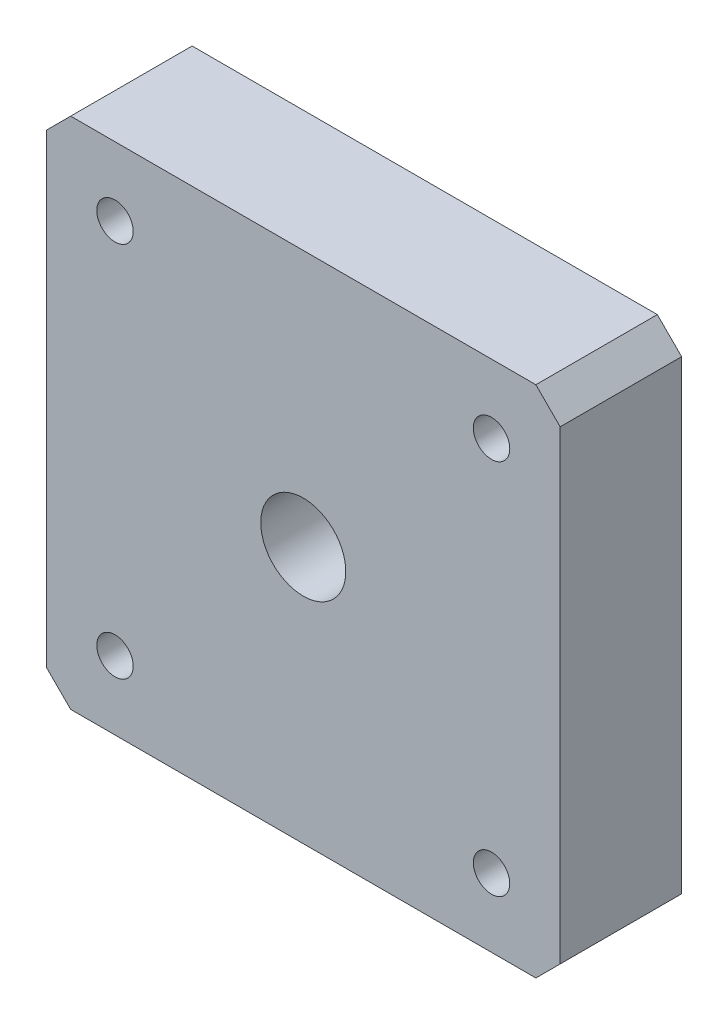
ISO-10303-21;
HEADER;
FILE_DESCRIPTION(('STEP AP214'),'2;1');
FILE_NAME('part.step','',(''),(''),'','','');
FILE_SCHEMA(('AUTOMOTIVE_DESIGN { 1 0 10303 214 1 1 1 1 }'));
ENDSEC;
DATA;
#1=APPLICATION_CONTEXT('core data for automotive mechanical design processes');
#2=APPLICATION_PROTOCOL_DEFINITION('international standard','automotive_design',2000,#1);
#3=PRODUCT_CONTEXT('',#1,'mechanical');
#4=PRODUCT('Part','Part','',(#3));
#5=PRODUCT_RELATED_PRODUCT_CATEGORY('part','',(#4));
#6=PRODUCT_DEFINITION_FORMATION('','',#4);
#7=PRODUCT_DEFINITION_CONTEXT('part definition',#1,'design');
#8=PRODUCT_DEFINITION('design','',#6,#7);
#9=PRODUCT_DEFINITION_SHAPE('','',#8);
#10=(LENGTH_UNIT() NAMED_UNIT(*) SI_UNIT(.MILLI.,.METRE.));
#11=(NAMED_UNIT(*) PLANE_ANGLE_UNIT() SI_UNIT($,.RADIAN.));
#12=(NAMED_UNIT(*) SI_UNIT($,.STERADIAN.) SOLID_ANGLE_UNIT());
#13=UNCERTAINTY_MEASURE_WITH_UNIT(LENGTH_MEASURE(1.E-05),#10,'distance_accuracy_value','');
#14=(GEOMETRIC_REPRESENTATION_CONTEXT(3) GLOBAL_UNCERTAINTY_ASSIGNED_CONTEXT((#13)) GLOBAL_UNIT_ASSIGNED_CONTEXT((#10,
#11,#12)) REPRESENTATION_CONTEXT('',''));
#15=CARTESIAN_POINT('',(0.,0.,0.));
#16=DIRECTION('',(0.,0.,1.));
#17=DIRECTION('',(1.,0.,0.));
#18=AXIS2_PLACEMENT_3D('',#15,#16,#17);
#19=CARTESIAN_POINT('',(-21.15,-19.15,10.));
#20=DIRECTION('',(1.,0.,0.));
#21=DIRECTION('',(0.,0.,-1.));
#22=AXIS2_PLACEMENT_3D('',#19,#20,#21);
#23=PLANE('',#22);
#24=DIRECTION('',(0.,-1.,0.));
#25=VECTOR('',#24,1.);
#26=CARTESIAN_POINT('',(-21.15,-19.15,0.));
#27=LINE('',#26,#25);
#28=CARTESIAN_POINT('',(-21.15,19.15,0.));
#29=VERTEX_POINT('',#28);
#30=CARTESIAN_POINT('',(-21.15,-19.15,0.));
#31=VERTEX_POINT('',#30);
#32=EDGE_CURVE('E129',#29,#31,#27,.T.);
#33=ORIENTED_EDGE('',*,*,#32,.T.);
#34=DIRECTION('',(0.,0.,-1.));
#35=VECTOR('',#34,1.);
#36=CARTESIAN_POINT('',(-21.15,-19.15,10.));
#37=LINE('',#36,#35);
#38=CARTESIAN_POINT('',(-21.15,-19.15,10.));
#39=VERTEX_POINT('',#38);
#40=EDGE_CURVE('E11',#39,#31,#37,.T.);
#41=ORIENTED_EDGE('',*,*,#40,.F.);
#42=DIRECTION('',(0.,-1.,0.));
#43=VECTOR('',#42,1.);
#44=CARTESIAN_POINT('',(-21.15,-19.15,10.));
#45=LINE('',#44,#43);
#46=CARTESIAN_POINT('',(-21.15,19.15,10.));
#47=VERTEX_POINT('',#46);
#48=EDGE_CURVE('E144',#47,#39,#45,.T.);
#49=ORIENTED_EDGE('',*,*,#48,.F.);
#50=DIRECTION('',(0.,0.,-1.));
#51=VECTOR('',#50,1.);
#52=CARTESIAN_POINT('',(-21.15,19.15,10.));
#53=LINE('',#52,#51);
#54=EDGE_CURVE('E125',#47,#29,#53,.T.);
#55=ORIENTED_EDGE('',*,*,#54,.T.);
#56=EDGE_LOOP('',(#33,#41,#49,#55));
#57=FACE_BOUND('',#56,.T.);
#58=ADVANCED_FACE('F33',(#57),#23,.F.);
#59=CARTESIAN_POINT('',(-21.15,-19.15,10.));
#60=DIRECTION('',(0.707106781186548,0.707106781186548,0.));
#61=DIRECTION('',(-0.707106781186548,0.707106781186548,0.));
#62=AXIS2_PLACEMENT_3D('',#59,#60,#61);
#63=PLANE('',#62);
#64=DIRECTION('',(0.707106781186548,-0.707106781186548,0.));
#65=VECTOR('',#64,1.);
#66=CARTESIAN_POINT('',(-21.15,-19.15,0.));
#67=LINE('',#66,#65);
#68=CARTESIAN_POINT('',(-19.15,-21.15,0.));
#69=VERTEX_POINT('',#68);
#70=EDGE_CURVE('E132',#31,#69,#67,.T.);
#71=ORIENTED_EDGE('',*,*,#70,.T.);
#72=DIRECTION('',(0.,0.,-1.));
#73=VECTOR('',#72,1.);
#74=CARTESIAN_POINT('',(-19.15,-21.15,10.));
#75=LINE('',#74,#73);
#76=CARTESIAN_POINT('',(-19.15,-21.15,10.));
#77=VERTEX_POINT('',#76);
#78=EDGE_CURVE('E41',#77,#69,#75,.T.);
#79=ORIENTED_EDGE('',*,*,#78,.F.);
#80=DIRECTION('',(0.707106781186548,-0.707106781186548,0.));
#81=VECTOR('',#80,1.);
#82=CARTESIAN_POINT('',(-21.15,-19.15,10.));
#83=LINE('',#82,#81);
#84=EDGE_CURVE('E92',#39,#77,#83,.T.);
#85=ORIENTED_EDGE('',*,*,#84,.F.);
#86=ORIENTED_EDGE('',*,*,#40,.T.);
#87=EDGE_LOOP('',(#71,#79,#85,#86));
#88=FACE_BOUND('',#87,.T.);
#89=ADVANCED_FACE('F246',(#88),#63,.F.);
#90=CARTESIAN_POINT('',(19.15,-21.15,10.));
#91=DIRECTION('',(0.,1.,0.));
#92=DIRECTION('',(-1.,0.,0.));
#93=AXIS2_PLACEMENT_3D('',#90,#91,#92);
#94=PLANE('',#93);
#95=DIRECTION('',(1.,0.,0.));
#96=VECTOR('',#95,1.);
#97=CARTESIAN_POINT('',(19.15,-21.15,0.));
#98=LINE('',#97,#96);
#99=CARTESIAN_POINT('',(19.15,-21.15,0.));
#100=VERTEX_POINT('',#99);
#101=EDGE_CURVE('E135',#69,#100,#98,.T.);
#102=ORIENTED_EDGE('',*,*,#101,.T.);
#103=DIRECTION('',(0.,0.,-1.));
#104=VECTOR('',#103,1.);
#105=CARTESIAN_POINT('',(19.15,-21.15,10.));
#106=LINE('',#105,#104);
#107=CARTESIAN_POINT('',(19.15,-21.15,10.));
#108=VERTEX_POINT('',#107);
#109=EDGE_CURVE('E151',#108,#100,#106,.T.);
#110=ORIENTED_EDGE('',*,*,#109,.F.);
#111=DIRECTION('',(1.,0.,0.));
#112=VECTOR('',#111,1.);
#113=CARTESIAN_POINT('',(19.15,-21.15,10.));
#114=LINE('',#113,#112);
#115=EDGE_CURVE('E159',#77,#108,#114,.T.);
#116=ORIENTED_EDGE('',*,*,#115,.F.);
#117=ORIENTED_EDGE('',*,*,#78,.T.);
#118=EDGE_LOOP('',(#102,#110,#116,#117));
#119=FACE_BOUND('',#118,.T.);
#120=ADVANCED_FACE('F157',(#119),#94,.F.);
#121=CARTESIAN_POINT('',(21.15,-19.15,10.));
#122=DIRECTION('',(-0.707106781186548,0.707106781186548,0.));
#123=DIRECTION('',(-0.707106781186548,-0.707106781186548,0.));
#124=AXIS2_PLACEMENT_3D('',#121,#122,#123);
#125=PLANE('',#124);
#126=DIRECTION('',(0.707106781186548,0.707106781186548,0.));
#127=VECTOR('',#126,1.);
#128=CARTESIAN_POINT('',(21.15,-19.15,0.));
#129=LINE('',#128,#127);
#130=CARTESIAN_POINT('',(21.15,-19.15,0.));
#131=VERTEX_POINT('',#130);
#132=EDGE_CURVE('E137',#100,#131,#129,.T.);
#133=ORIENTED_EDGE('',*,*,#132,.T.);
#134=DIRECTION('',(0.,0.,-1.));
#135=VECTOR('',#134,1.);
#136=CARTESIAN_POINT('',(21.15,-19.15,10.));
#137=LINE('',#136,#135);
#138=CARTESIAN_POINT('',(21.15,-19.15,10.));
#139=VERTEX_POINT('',#138);
#140=EDGE_CURVE('E148',#139,#131,#137,.T.);
#141=ORIENTED_EDGE('',*,*,#140,.F.);
#142=DIRECTION('',(0.707106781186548,0.707106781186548,0.));
#143=VECTOR('',#142,1.);
#144=CARTESIAN_POINT('',(21.15,-19.15,10.));
#145=LINE('',#144,#143);
#146=EDGE_CURVE('E171',#108,#139,#145,.T.);
#147=ORIENTED_EDGE('',*,*,#146,.F.);
#148=ORIENTED_EDGE('',*,*,#109,.T.);
#149=EDGE_LOOP('',(#133,#141,#147,#148));
#150=FACE_BOUND('',#149,.T.);
#151=ADVANCED_FACE('F167',(#150),#125,.F.);
#152=CARTESIAN_POINT('',(21.15,-19.15,10.));
#153=DIRECTION('',(-1.,0.,0.));
#154=DIRECTION('',(0.,0.,1.));
#155=AXIS2_PLACEMENT_3D('',#152,#153,#154);
#156=PLANE('',#155);
#157=DIRECTION('',(0.,1.,0.));
#158=VECTOR('',#157,1.);
#159=CARTESIAN_POINT('',(21.15,-19.15,0.));
#160=LINE('',#159,#158);
#161=CARTESIAN_POINT('',(21.15,19.15,0.));
#162=VERTEX_POINT('',#161);
#163=EDGE_CURVE('E139',#131,#162,#160,.T.);
#164=ORIENTED_EDGE('',*,*,#163,.T.);
#165=DIRECTION('',(0.,0.,-1.));
#166=VECTOR('',#165,1.);
#167=CARTESIAN_POINT('',(21.15,19.15,10.));
#168=LINE('',#167,#166);
#169=CARTESIAN_POINT('',(21.15,19.15,10.));
#170=VERTEX_POINT('',#169);
#171=EDGE_CURVE('E120',#170,#162,#168,.T.);
#172=ORIENTED_EDGE('',*,*,#171,.F.);
#173=DIRECTION('',(0.,1.,0.));
#174=VECTOR('',#173,1.);
#175=CARTESIAN_POINT('',(21.15,-19.15,10.));
#176=LINE('',#175,#174);
#177=EDGE_CURVE('E111',#139,#170,#176,.T.);
#178=ORIENTED_EDGE('',*,*,#177,.F.);
#179=ORIENTED_EDGE('',*,*,#140,.T.);
#180=EDGE_LOOP('',(#164,#172,#178,#179));
#181=FACE_BOUND('',#180,.T.);
#182=ADVANCED_FACE('F170',(#181),#156,.F.);
#183=CARTESIAN_POINT('',(19.15,21.15,10.));
#184=DIRECTION('',(-0.707106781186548,-0.707106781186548,0.));
#185=DIRECTION('',(0.707106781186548,-0.707106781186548,0.));
#186=AXIS2_PLACEMENT_3D('',#183,#184,#185);
#187=PLANE('',#186);
#188=DIRECTION('',(-0.707106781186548,0.707106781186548,0.));
#189=VECTOR('',#188,1.);
#190=CARTESIAN_POINT('',(19.15,21.15,0.));
#191=LINE('',#190,#189);
#192=CARTESIAN_POINT('',(19.15,21.15,0.));
#193=VERTEX_POINT('',#192);
#194=EDGE_CURVE('E119',#162,#193,#191,.T.);
#195=ORIENTED_EDGE('',*,*,#194,.T.);
#196=DIRECTION('',(0.,0.,-1.));
#197=VECTOR('',#196,1.);
#198=CARTESIAN_POINT('',(19.15,21.15,10.));
#199=LINE('',#198,#197);
#200=CARTESIAN_POINT('',(19.15,21.15,10.));
#201=VERTEX_POINT('',#200);
#202=EDGE_CURVE('E116',#201,#193,#199,.T.);
#203=ORIENTED_EDGE('',*,*,#202,.F.);
#204=DIRECTION('',(-0.707106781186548,0.707106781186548,0.));
#205=VECTOR('',#204,1.);
#206=CARTESIAN_POINT('',(19.15,21.15,10.));
#207=LINE('',#206,#205);
#208=EDGE_CURVE('E105',#170,#201,#207,.T.);
#209=ORIENTED_EDGE('',*,*,#208,.F.);
#210=ORIENTED_EDGE('',*,*,#171,.T.);
#211=EDGE_LOOP('',(#195,#203,#209,#210));
#212=FACE_BOUND('',#211,.T.);
#213=ADVANCED_FACE('F117',(#212),#187,.F.);
#214=CARTESIAN_POINT('',(19.15,21.15,10.));
#215=DIRECTION('',(0.,-1.,0.));
#216=DIRECTION('',(1.,0.,0.));
#217=AXIS2_PLACEMENT_3D('',#214,#215,#216);
#218=PLANE('',#217);
#219=DIRECTION('',(-1.,0.,0.));
#220=VECTOR('',#219,1.);
#221=CARTESIAN_POINT('',(19.15,21.15,0.));
#222=LINE('',#221,#220);
#223=CARTESIAN_POINT('',(-19.15,21.15,0.));
#224=VERTEX_POINT('',#223);
#225=EDGE_CURVE('E78',#193,#224,#222,.T.);
#226=ORIENTED_EDGE('',*,*,#225,.T.);
#227=DIRECTION('',(0.,0.,-1.));
#228=VECTOR('',#227,1.);
#229=CARTESIAN_POINT('',(-19.15,21.15,10.));
#230=LINE('',#229,#228);
#231=CARTESIAN_POINT('',(-19.15,21.15,10.));
#232=VERTEX_POINT('',#231);
#233=EDGE_CURVE('E121',#232,#224,#230,.T.);
#234=ORIENTED_EDGE('',*,*,#233,.F.);
#235=DIRECTION('',(-1.,0.,0.));
#236=VECTOR('',#235,1.);
#237=CARTESIAN_POINT('',(19.15,21.15,10.));
#238=LINE('',#237,#236);
#239=EDGE_CURVE('E109',#201,#232,#238,.T.);
#240=ORIENTED_EDGE('',*,*,#239,.F.);
#241=ORIENTED_EDGE('',*,*,#202,.T.);
#242=EDGE_LOOP('',(#226,#234,#240,#241));
#243=FACE_BOUND('',#242,.T.);
#244=ADVANCED_FACE('F123',(#243),#218,.F.);
#245=CARTESIAN_POINT('',(-19.15,21.15,10.));
#246=DIRECTION('',(0.707106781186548,-0.707106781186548,0.));
#247=DIRECTION('',(0.707106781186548,0.707106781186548,0.));
#248=AXIS2_PLACEMENT_3D('',#245,#246,#247);
#249=PLANE('',#248);
#250=DIRECTION('',(-0.707106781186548,-0.707106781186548,0.));
#251=VECTOR('',#250,1.);
#252=CARTESIAN_POINT('',(-19.15,21.15,0.));
#253=LINE('',#252,#251);
#254=EDGE_CURVE('E84',#224,#29,#253,.T.);
#255=ORIENTED_EDGE('',*,*,#254,.T.);
#256=ORIENTED_EDGE('',*,*,#54,.F.);
#257=DIRECTION('',(-0.707106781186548,-0.707106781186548,0.));
#258=VECTOR('',#257,1.);
#259=CARTESIAN_POINT('',(-19.15,21.15,10.));
#260=LINE('',#259,#258);
#261=EDGE_CURVE('E49',#232,#47,#260,.T.);
#262=ORIENTED_EDGE('',*,*,#261,.F.);
#263=ORIENTED_EDGE('',*,*,#233,.T.);
#264=EDGE_LOOP('',(#255,#256,#262,#263));
#265=FACE_BOUND('',#264,.T.);
#266=ADVANCED_FACE('F253',(#265),#249,.F.);
#267=CARTESIAN_POINT('',(0.,0.,10.));
#268=DIRECTION('',(0.,0.,1.));
#269=DIRECTION('',(1.,0.,0.));
#270=AXIS2_PLACEMENT_3D('',#267,#268,#269);
#271=PLANE('',#270);
#272=CARTESIAN_POINT('',(-15.4999999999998,15.5000000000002,10.));
#273=DIRECTION('',(0.,0.,1.));
#274=DIRECTION('',(1.,0.,0.));
#275=AXIS2_PLACEMENT_3D('',#272,#273,#274);
#276=CIRCLE('',#275,1.5);
#277=CARTESIAN_POINT('',(-13.9999999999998,15.5000000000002,10.));
#278=VERTEX_POINT('',#277);
#279=EDGE_CURVE('E212',#278,#278,#276,.T.);
#280=ORIENTED_EDGE('',*,*,#279,.F.);
#281=EDGE_LOOP('',(#280));
#282=FACE_BOUND('',#281,.T.);
#283=CARTESIAN_POINT('',(-15.5,-15.5,10.));
#284=DIRECTION('',(0.,0.,1.));
#285=DIRECTION('',(1.,0.,0.));
#286=AXIS2_PLACEMENT_3D('',#283,#284,#285);
#287=CIRCLE('',#286,1.5);
#288=CARTESIAN_POINT('',(-14.,-15.5,10.));
#289=VERTEX_POINT('',#288);
#290=EDGE_CURVE('E206',#289,#289,#287,.T.);
#291=ORIENTED_EDGE('',*,*,#290,.F.);
#292=EDGE_LOOP('',(#291));
#293=FACE_BOUND('',#292,.T.);
#294=CARTESIAN_POINT('',(15.4999999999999,-15.5000000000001,10.));
#295=DIRECTION('',(0.,0.,1.));
#296=DIRECTION('',(1.,0.,0.));
#297=AXIS2_PLACEMENT_3D('',#294,#295,#296);
#298=CIRCLE('',#297,1.5);
#299=CARTESIAN_POINT('',(16.9999999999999,-15.5000000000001,10.));
#300=VERTEX_POINT('',#299);
#301=EDGE_CURVE('E200',#300,#300,#298,.T.);
#302=ORIENTED_EDGE('',*,*,#301,.F.);
#303=EDGE_LOOP('',(#302));
#304=FACE_BOUND('',#303,.T.);
#305=CARTESIAN_POINT('',(15.5,15.5,10.));
#306=DIRECTION('',(0.,0.,1.));
#307=DIRECTION('',(1.,0.,0.));
#308=AXIS2_PLACEMENT_3D('',#305,#306,#307);
#309=CIRCLE('',#308,1.5);
#310=CARTESIAN_POINT('',(17.,15.5,10.));
#311=VERTEX_POINT('',#310);
#312=EDGE_CURVE('E192',#311,#311,#309,.T.);
#313=ORIENTED_EDGE('',*,*,#312,.F.);
#314=EDGE_LOOP('',(#313));
#315=FACE_BOUND('',#314,.T.);
#316=CARTESIAN_POINT('',(0.,0.,10.));
#317=DIRECTION('',(0.,0.,-1.));
#318=DIRECTION('',(-1.,0.,0.));
#319=AXIS2_PLACEMENT_3D('',#316,#317,#318);
#320=CIRCLE('',#319,3.5);
#321=CARTESIAN_POINT('',(-3.5,0.,10.));
#322=VERTEX_POINT('',#321);
#323=EDGE_CURVE('E188',#322,#322,#320,.T.);
#324=ORIENTED_EDGE('',*,*,#323,.T.);
#325=EDGE_LOOP('',(#324));
#326=FACE_BOUND('',#325,.T.);
#327=ORIENTED_EDGE('',*,*,#48,.T.);
#328=ORIENTED_EDGE('',*,*,#84,.T.);
#329=ORIENTED_EDGE('',*,*,#115,.T.);
#330=ORIENTED_EDGE('',*,*,#146,.T.);
#331=ORIENTED_EDGE('',*,*,#177,.T.);
#332=ORIENTED_EDGE('',*,*,#208,.T.);
#333=ORIENTED_EDGE('',*,*,#239,.T.);
#334=ORIENTED_EDGE('',*,*,#261,.T.);
#335=EDGE_LOOP('',(#327,#328,#329,#330,#331,#332,#333,#334));
#336=FACE_BOUND('',#335,.T.);
#337=ADVANCED_FACE('F107',(#282,#293,#304,#315,#326,#336),#271,.T.);
#338=CARTESIAN_POINT('',(0.,0.,0.));
#339=DIRECTION('',(0.,0.,1.));
#340=DIRECTION('',(1.,0.,0.));
#341=AXIS2_PLACEMENT_3D('',#338,#339,#340);
#342=PLANE('',#341);
#343=CARTESIAN_POINT('',(-15.4999999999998,15.5000000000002,0.));
#344=DIRECTION('',(0.,0.,-1.));
#345=DIRECTION('',(0.,-1.,0.));
#346=AXIS2_PLACEMENT_3D('',#343,#344,#345);
#347=CIRCLE('',#346,1.5);
#348=CARTESIAN_POINT('',(-15.4999999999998,14.0000000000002,0.));
#349=VERTEX_POINT('',#348);
#350=EDGE_CURVE('E215',#349,#349,#347,.T.);
#351=ORIENTED_EDGE('',*,*,#350,.F.);
#352=EDGE_LOOP('',(#351));
#353=FACE_BOUND('',#352,.T.);
#354=CARTESIAN_POINT('',(-15.5,-15.5,0.));
#355=DIRECTION('',(0.,0.,-1.));
#356=DIRECTION('',(1.,0.,0.));
#357=AXIS2_PLACEMENT_3D('',#354,#355,#356);
#358=CIRCLE('',#357,1.5);
#359=CARTESIAN_POINT('',(-14.,-15.5,0.));
#360=VERTEX_POINT('',#359);
#361=EDGE_CURVE('E209',#360,#360,#358,.T.);
#362=ORIENTED_EDGE('',*,*,#361,.F.);
#363=EDGE_LOOP('',(#362));
#364=FACE_BOUND('',#363,.T.);
#365=CARTESIAN_POINT('',(15.4999999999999,-15.5000000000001,0.));
#366=DIRECTION('',(0.,0.,-1.));
#367=DIRECTION('',(0.,1.,0.));
#368=AXIS2_PLACEMENT_3D('',#365,#366,#367);
#369=CIRCLE('',#368,1.5);
#370=CARTESIAN_POINT('',(15.4999999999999,-14.0000000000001,0.));
#371=VERTEX_POINT('',#370);
#372=EDGE_CURVE('E203',#371,#371,#369,.T.);
#373=ORIENTED_EDGE('',*,*,#372,.F.);
#374=EDGE_LOOP('',(#373));
#375=FACE_BOUND('',#374,.T.);
#376=CARTESIAN_POINT('',(15.5,15.5,0.));
#377=DIRECTION('',(0.,0.,-1.));
#378=DIRECTION('',(-1.,0.,0.));
#379=AXIS2_PLACEMENT_3D('',#376,#377,#378);
#380=CIRCLE('',#379,1.5);
#381=CARTESIAN_POINT('',(14.,15.5,0.));
#382=VERTEX_POINT('',#381);
#383=EDGE_CURVE('E197',#382,#382,#380,.T.);
#384=ORIENTED_EDGE('',*,*,#383,.F.);
#385=EDGE_LOOP('',(#384));
#386=FACE_BOUND('',#385,.T.);
#387=CARTESIAN_POINT('',(0.,0.,0.));
#388=DIRECTION('',(0.,0.,-1.));
#389=DIRECTION('',(-1.,0.,0.));
#390=AXIS2_PLACEMENT_3D('',#387,#388,#389);
#391=CIRCLE('',#390,11.5);
#392=CARTESIAN_POINT('',(-11.5,0.,0.));
#393=VERTEX_POINT('',#392);
#394=EDGE_CURVE('E177',#393,#393,#391,.T.);
#395=ORIENTED_EDGE('',*,*,#394,.F.);
#396=EDGE_LOOP('',(#395));
#397=FACE_BOUND('',#396,.T.);
#398=ORIENTED_EDGE('',*,*,#32,.F.);
#399=ORIENTED_EDGE('',*,*,#254,.F.);
#400=ORIENTED_EDGE('',*,*,#225,.F.);
#401=ORIENTED_EDGE('',*,*,#194,.F.);
#402=ORIENTED_EDGE('',*,*,#163,.F.);
#403=ORIENTED_EDGE('',*,*,#132,.F.);
#404=ORIENTED_EDGE('',*,*,#101,.F.);
#405=ORIENTED_EDGE('',*,*,#70,.F.);
#406=EDGE_LOOP('',(#398,#399,#400,#401,#402,#403,#404,#405));
#407=FACE_BOUND('',#406,.T.);
#408=ADVANCED_FACE('F163',(#353,#364,#375,#386,#397,#407),#342,.F.);
#409=CARTESIAN_POINT('',(0.,0.,0.5));
#410=DIRECTION('',(0.,0.,-1.));
#411=DIRECTION('',(-1.,0.,0.));
#412=AXIS2_PLACEMENT_3D('',#409,#410,#411);
#413=CYLINDRICAL_SURFACE('',#412,11.5);
#414=CARTESIAN_POINT('',(0.,0.,0.5));
#415=DIRECTION('',(0.,0.,-1.));
#416=DIRECTION('',(-1.,0.,0.));
#417=AXIS2_PLACEMENT_3D('',#414,#415,#416);
#418=CIRCLE('',#417,11.5);
#419=CARTESIAN_POINT('',(-11.5,0.,0.5));
#420=VERTEX_POINT('',#419);
#421=EDGE_CURVE('E133',#420,#420,#418,.T.);
#422=ORIENTED_EDGE('',*,*,#421,.F.);
#423=EDGE_LOOP('',(#422));
#424=FACE_BOUND('',#423,.T.);
#425=ORIENTED_EDGE('',*,*,#394,.T.);
#426=EDGE_LOOP('',(#425));
#427=FACE_BOUND('',#426,.T.);
#428=ADVANCED_FACE('F223',(#424,#427),#413,.F.);
#429=CARTESIAN_POINT('',(0.,0.,0.5));
#430=DIRECTION('',(0.,0.,-1.));
#431=DIRECTION('',(-1.,0.,0.));
#432=AXIS2_PLACEMENT_3D('',#429,#430,#431);
#433=PLANE('',#432);
#434=CARTESIAN_POINT('',(0.,0.,0.5));
#435=DIRECTION('',(0.,0.,-1.));
#436=DIRECTION('',(-1.,0.,0.));
#437=AXIS2_PLACEMENT_3D('',#434,#435,#436);
#438=CIRCLE('',#437,11.);
#439=CARTESIAN_POINT('',(-11.,0.,0.5));
#440=VERTEX_POINT('',#439);
#441=EDGE_CURVE('E180',#440,#440,#438,.T.);
#442=ORIENTED_EDGE('',*,*,#441,.F.);
#443=EDGE_LOOP('',(#442));
#444=FACE_BOUND('',#443,.T.);
#445=ORIENTED_EDGE('',*,*,#421,.T.);
#446=EDGE_LOOP('',(#445));
#447=FACE_BOUND('',#446,.T.);
#448=ADVANCED_FACE('F234',(#444,#447),#433,.T.);
#449=CARTESIAN_POINT('',(0.,0.,0.5));
#450=DIRECTION('',(0.,0.,-1.));
#451=DIRECTION('',(-1.,0.,0.));
#452=AXIS2_PLACEMENT_3D('',#449,#450,#451);
#453=CYLINDRICAL_SURFACE('',#452,11.);
#454=ORIENTED_EDGE('',*,*,#441,.T.);
#455=EDGE_LOOP('',(#454));
#456=FACE_BOUND('',#455,.T.);
#457=CARTESIAN_POINT('',(0.,0.,-2.));
#458=DIRECTION('',(0.,0.,-1.));
#459=DIRECTION('',(-1.,0.,0.));
#460=AXIS2_PLACEMENT_3D('',#457,#458,#459);
#461=CIRCLE('',#460,11.);
#462=CARTESIAN_POINT('',(-11.,0.,-2.));
#463=VERTEX_POINT('',#462);
#464=EDGE_CURVE('E185',#463,#463,#461,.T.);
#465=ORIENTED_EDGE('',*,*,#464,.F.);
#466=EDGE_LOOP('',(#465));
#467=FACE_BOUND('',#466,.T.);
#468=ADVANCED_FACE('F240',(#456,#467),#453,.T.);
#469=CARTESIAN_POINT('',(0.,0.,-2.));
#470=DIRECTION('',(0.,0.,-1.));
#471=DIRECTION('',(-1.,0.,0.));
#472=AXIS2_PLACEMENT_3D('',#469,#470,#471);
#473=PLANE('',#472);
#474=CARTESIAN_POINT('',(0.,0.,-2.));
#475=DIRECTION('',(0.,0.,-1.));
#476=DIRECTION('',(-1.,0.,0.));
#477=AXIS2_PLACEMENT_3D('',#474,#475,#476);
#478=CIRCLE('',#477,3.5);
#479=CARTESIAN_POINT('',(-3.5,0.,-2.));
#480=VERTEX_POINT('',#479);
#481=EDGE_CURVE('E189',#480,#480,#478,.T.);
#482=ORIENTED_EDGE('',*,*,#481,.F.);
#483=EDGE_LOOP('',(#482));
#484=FACE_BOUND('',#483,.T.);
#485=ORIENTED_EDGE('',*,*,#464,.T.);
#486=EDGE_LOOP('',(#485));
#487=FACE_BOUND('',#486,.T.);
#488=ADVANCED_FACE('F316',(#484,#487),#473,.T.);
#489=CARTESIAN_POINT('',(0.,0.,10.));
#490=DIRECTION('',(0.,0.,-1.));
#491=DIRECTION('',(-1.,0.,0.));
#492=AXIS2_PLACEMENT_3D('',#489,#490,#491);
#493=CYLINDRICAL_SURFACE('',#492,3.5);
#494=ORIENTED_EDGE('',*,*,#323,.F.);
#495=EDGE_LOOP('',(#494));
#496=FACE_BOUND('',#495,.T.);
#497=ORIENTED_EDGE('',*,*,#481,.T.);
#498=EDGE_LOOP('',(#497));
#499=FACE_BOUND('',#498,.T.);
#500=ADVANCED_FACE('F326',(#496,#499),#493,.F.);
#501=CARTESIAN_POINT('',(15.5,15.5,12.));
#502=DIRECTION('',(0.,0.,-1.));
#503=DIRECTION('',(-1.,0.,0.));
#504=AXIS2_PLACEMENT_3D('',#501,#502,#503);
#505=CYLINDRICAL_SURFACE('',#504,1.5);
#506=ORIENTED_EDGE('',*,*,#312,.T.);
#507=EDGE_LOOP('',(#506));
#508=FACE_BOUND('',#507,.T.);
#509=ORIENTED_EDGE('',*,*,#383,.T.);
#510=EDGE_LOOP('',(#509));
#511=FACE_BOUND('',#510,.T.);
#512=ADVANCED_FACE('F336',(#508,#511),#505,.F.);
#513=CARTESIAN_POINT('',(15.4999999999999,-15.5000000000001,12.));
#514=DIRECTION('',(0.,0.,-1.));
#515=DIRECTION('',(-1.,0.,0.));
#516=AXIS2_PLACEMENT_3D('',#513,#514,#515);
#517=CYLINDRICAL_SURFACE('',#516,1.5);
#518=ORIENTED_EDGE('',*,*,#301,.T.);
#519=EDGE_LOOP('',(#518));
#520=FACE_BOUND('',#519,.T.);
#521=ORIENTED_EDGE('',*,*,#372,.T.);
#522=EDGE_LOOP('',(#521));
#523=FACE_BOUND('',#522,.T.);
#524=ADVANCED_FACE('F346',(#520,#523),#517,.F.);
#525=CARTESIAN_POINT('',(-15.5,-15.5,12.));
#526=DIRECTION('',(0.,0.,-1.));
#527=DIRECTION('',(-1.,0.,0.));
#528=AXIS2_PLACEMENT_3D('',#525,#526,#527);
#529=CYLINDRICAL_SURFACE('',#528,1.5);
#530=ORIENTED_EDGE('',*,*,#290,.T.);
#531=EDGE_LOOP('',(#530));
#532=FACE_BOUND('',#531,.T.);
#533=ORIENTED_EDGE('',*,*,#361,.T.);
#534=EDGE_LOOP('',(#533));
#535=FACE_BOUND('',#534,.T.);
#536=ADVANCED_FACE('F366',(#532,#535),#529,.F.);
#537=CARTESIAN_POINT('',(-15.4999999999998,15.5000000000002,12.));
#538=DIRECTION('',(0.,0.,-1.));
#539=DIRECTION('',(-1.,0.,0.));
#540=AXIS2_PLACEMENT_3D('',#537,#538,#539);
#541=CYLINDRICAL_SURFACE('',#540,1.5);
#542=ORIENTED_EDGE('',*,*,#279,.T.);
#543=EDGE_LOOP('',(#542));
#544=FACE_BOUND('',#543,.T.);
#545=ORIENTED_EDGE('',*,*,#350,.T.);
#546=EDGE_LOOP('',(#545));
#547=FACE_BOUND('',#546,.T.);
#548=ADVANCED_FACE('F219',(#544,#547),#541,.F.);
#549=CLOSED_SHELL('',(#58,#89,#120,#151,#182,#213,#244,#266,#337,#408,#428,#448,#468,#488,#500,
#512,#524,#536,#548));
#550=MANIFOLD_SOLID_BREP('B2',#549);
#551=ADVANCED_BREP_SHAPE_REPRESENTATION('',(#18,#550),#14);
#552=SHAPE_DEFINITION_REPRESENTATION(#9,#551);
ENDSEC;
END-ISO-10303-21;
